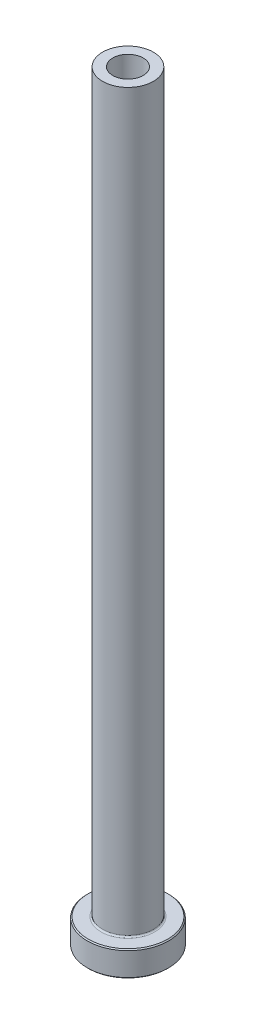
from build123d import *

# Parameters (mm, degrees)
FILLET1_R     = 0.3
CHAMFER1_SIZE = 0.2
CHAMFER3_SIZE = 0.5


with BuildPart() as part:
    # Sketch1 → Revolve1 (revolve)
    with BuildSketch(Plane.XY, mode=Mode.PRIVATE) as revolve1_sk:
        Polygon((-3, 150), (-5, 150), (-5, 5), (-8, 5), (-8, 0), (-3.25, 0), (-3.25, 93), (-3, 105), align=None)
    revolve(revolve1_sk.sketch.rotate(Axis((0, 92.187680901, 0), (0, -1, 0)), 270), axis=Axis((0, 92.187680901, 0), (0, -1, 0)))

    # Fillet1
    fillet1_edges = [part.edges().sort_by_distance(p)[0] for p in [
        (0, 5, -5),
    ]]
    fillet(fillet1_edges, radius=FILLET1_R)

    # Chamfer1
    chamfer1_edges = [part.edges().sort_by_distance(p)[0] for p in [
        (0, 0, -8),
        (0, 5, -8),
    ]]
    chamfer(chamfer1_edges, length=CHAMFER1_SIZE)

    # Chamfer3
    chamfer3_edges = [part.edges().sort_by_distance(p)[0] for p in [
        (0, 0, -3.25),
    ]]
    chamfer(chamfer3_edges, length=CHAMFER3_SIZE)


solid = part.part
